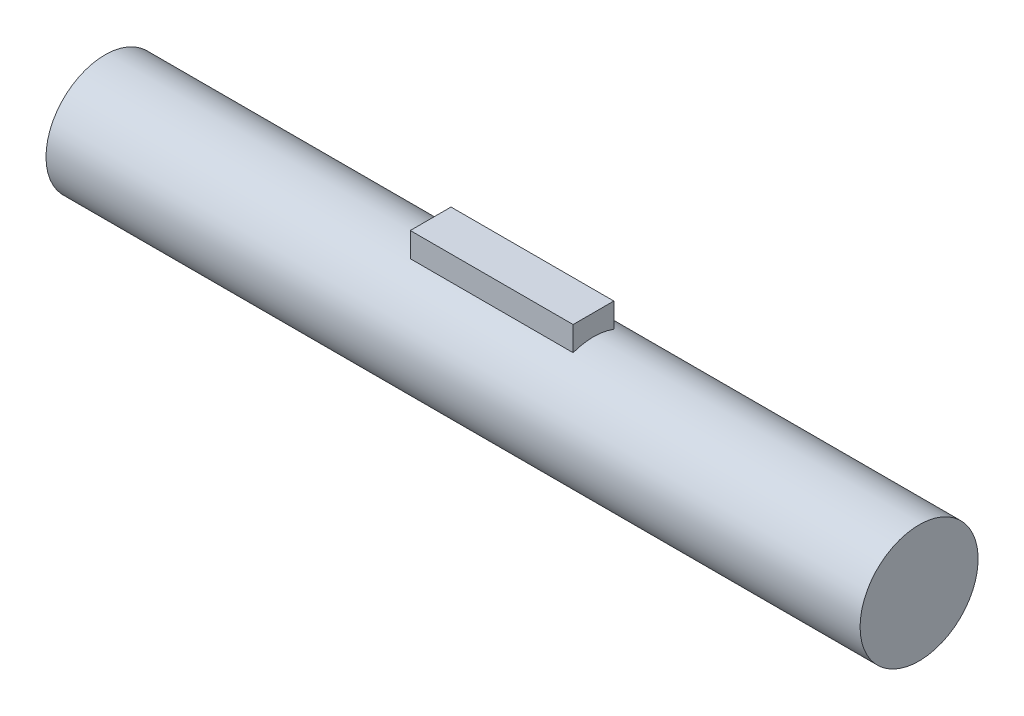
ISO-10303-21;
HEADER;
FILE_DESCRIPTION(('STEP AP214'),'2;1');
FILE_NAME('part.step','',(''),(''),'','','');
FILE_SCHEMA(('AUTOMOTIVE_DESIGN { 1 0 10303 214 1 1 1 1 }'));
ENDSEC;
DATA;
#1=APPLICATION_CONTEXT('core data for automotive mechanical design processes');
#2=APPLICATION_PROTOCOL_DEFINITION('international standard','automotive_design',2000,#1);
#3=PRODUCT_CONTEXT('',#1,'mechanical');
#4=PRODUCT('Part','Part','',(#3));
#5=PRODUCT_RELATED_PRODUCT_CATEGORY('part','',(#4));
#6=PRODUCT_DEFINITION_FORMATION('','',#4);
#7=PRODUCT_DEFINITION_CONTEXT('part definition',#1,'design');
#8=PRODUCT_DEFINITION('design','',#6,#7);
#9=PRODUCT_DEFINITION_SHAPE('','',#8);
#10=(LENGTH_UNIT() NAMED_UNIT(*) SI_UNIT(.MILLI.,.METRE.));
#11=(NAMED_UNIT(*) PLANE_ANGLE_UNIT() SI_UNIT($,.RADIAN.));
#12=(NAMED_UNIT(*) SI_UNIT($,.STERADIAN.) SOLID_ANGLE_UNIT());
#13=UNCERTAINTY_MEASURE_WITH_UNIT(LENGTH_MEASURE(1.E-05),#10,'distance_accuracy_value','');
#14=(GEOMETRIC_REPRESENTATION_CONTEXT(3) GLOBAL_UNCERTAINTY_ASSIGNED_CONTEXT((#13)) GLOBAL_UNIT_ASSIGNED_CONTEXT((#10,
#11,#12)) REPRESENTATION_CONTEXT('',''));
#15=CARTESIAN_POINT('',(0.,0.,0.));
#16=DIRECTION('',(0.,0.,1.));
#17=DIRECTION('',(1.,0.,0.));
#18=AXIS2_PLACEMENT_3D('',#15,#16,#17);
#19=CARTESIAN_POINT('',(2.,0.,0.));
#20=DIRECTION('',(1.,0.,0.));
#21=DIRECTION('',(0.,0.,-1.));
#22=AXIS2_PLACEMENT_3D('',#19,#20,#21);
#23=PLANE('',#22);
#24=DIRECTION('',(0.,-1.,0.));
#25=VECTOR('',#24,1.);
#26=CARTESIAN_POINT('',(2.,1.96106575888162,0.5));
#27=LINE('',#26,#25);
#28=CARTESIAN_POINT('',(2.,1.96106575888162,0.5));
#29=VERTEX_POINT('',#28);
#30=CARTESIAN_POINT('',(2.,1.36106575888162,0.5));
#31=VERTEX_POINT('',#30);
#32=EDGE_CURVE('E78',#29,#31,#27,.T.);
#33=ORIENTED_EDGE('',*,*,#32,.T.);
#34=CARTESIAN_POINT('',(2.,0.,0.));
#35=DIRECTION('',(-1.,0.,0.));
#36=DIRECTION('',(0.,0.,1.));
#37=AXIS2_PLACEMENT_3D('',#34,#35,#36);
#38=CIRCLE('',#37,1.45);
#39=CARTESIAN_POINT('',(2.,1.36106575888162,-0.5));
#40=VERTEX_POINT('',#39);
#41=EDGE_CURVE('E94',#31,#40,#38,.T.);
#42=ORIENTED_EDGE('',*,*,#41,.T.);
#43=DIRECTION('',(0.,1.,0.));
#44=VECTOR('',#43,1.);
#45=CARTESIAN_POINT('',(2.,1.96106575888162,-0.5));
#46=LINE('',#45,#44);
#47=CARTESIAN_POINT('',(2.,1.96106575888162,-0.5));
#48=VERTEX_POINT('',#47);
#49=EDGE_CURVE('E85',#40,#48,#46,.T.);
#50=ORIENTED_EDGE('',*,*,#49,.T.);
#51=DIRECTION('',(0.,0.,1.));
#52=VECTOR('',#51,1.);
#53=CARTESIAN_POINT('',(2.,1.96106575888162,-0.5));
#54=LINE('',#53,#52);
#55=EDGE_CURVE('E54',#48,#29,#54,.T.);
#56=ORIENTED_EDGE('',*,*,#55,.T.);
#57=EDGE_LOOP('',(#33,#42,#50,#56));
#58=FACE_BOUND('',#57,.T.);
#59=ADVANCED_FACE('F35',(#58),#23,.T.);
#60=CARTESIAN_POINT('',(-2.,0.,0.));
#61=DIRECTION('',(1.,0.,0.));
#62=DIRECTION('',(0.,0.,-1.));
#63=AXIS2_PLACEMENT_3D('',#60,#61,#62);
#64=PLANE('',#63);
#65=CARTESIAN_POINT('',(-2.,0.,0.));
#66=DIRECTION('',(-1.,0.,0.));
#67=DIRECTION('',(0.,0.,1.));
#68=AXIS2_PLACEMENT_3D('',#65,#66,#67);
#69=CIRCLE('',#68,1.45);
#70=CARTESIAN_POINT('',(-2.,1.36106575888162,0.5));
#71=VERTEX_POINT('',#70);
#72=CARTESIAN_POINT('',(-2.,1.36106575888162,-0.5));
#73=VERTEX_POINT('',#72);
#74=EDGE_CURVE('E95',#71,#73,#69,.T.);
#75=ORIENTED_EDGE('',*,*,#74,.F.);
#76=DIRECTION('',(0.,-1.,0.));
#77=VECTOR('',#76,1.);
#78=CARTESIAN_POINT('',(-2.,1.96106575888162,0.5));
#79=LINE('',#78,#77);
#80=CARTESIAN_POINT('',(-2.,1.96106575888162,0.5));
#81=VERTEX_POINT('',#80);
#82=EDGE_CURVE('E112',#81,#71,#79,.T.);
#83=ORIENTED_EDGE('',*,*,#82,.F.);
#84=DIRECTION('',(0.,0.,1.));
#85=VECTOR('',#84,1.);
#86=CARTESIAN_POINT('',(-2.,1.96106575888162,-0.5));
#87=LINE('',#86,#85);
#88=CARTESIAN_POINT('',(-2.,1.96106575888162,-0.5));
#89=VERTEX_POINT('',#88);
#90=EDGE_CURVE('E74',#89,#81,#87,.T.);
#91=ORIENTED_EDGE('',*,*,#90,.F.);
#92=DIRECTION('',(0.,1.,0.));
#93=VECTOR('',#92,1.);
#94=CARTESIAN_POINT('',(-2.,1.96106575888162,-0.5));
#95=LINE('',#94,#93);
#96=EDGE_CURVE('E69',#73,#89,#95,.T.);
#97=ORIENTED_EDGE('',*,*,#96,.F.);
#98=EDGE_LOOP('',(#75,#83,#91,#97));
#99=FACE_BOUND('',#98,.T.);
#100=ADVANCED_FACE('F133',(#99),#64,.F.);
#101=CARTESIAN_POINT('',(2.,1.96106575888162,0.5));
#102=DIRECTION('',(0.,0.,-1.));
#103=DIRECTION('',(0.,1.,0.));
#104=AXIS2_PLACEMENT_3D('',#101,#102,#103);
#105=PLANE('',#104);
#106=ORIENTED_EDGE('',*,*,#82,.T.);
#107=DIRECTION('',(-1.,0.,0.));
#108=VECTOR('',#107,1.);
#109=CARTESIAN_POINT('',(2.,1.36106575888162,0.5));
#110=LINE('',#109,#108);
#111=EDGE_CURVE('E11',#31,#71,#110,.T.);
#112=ORIENTED_EDGE('',*,*,#111,.F.);
#113=ORIENTED_EDGE('',*,*,#32,.F.);
#114=DIRECTION('',(-1.,0.,0.));
#115=VECTOR('',#114,1.);
#116=CARTESIAN_POINT('',(2.,1.96106575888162,0.5));
#117=LINE('',#116,#115);
#118=EDGE_CURVE('E116',#29,#81,#117,.T.);
#119=ORIENTED_EDGE('',*,*,#118,.T.);
#120=EDGE_LOOP('',(#106,#112,#113,#119));
#121=FACE_BOUND('',#120,.T.);
#122=ADVANCED_FACE('F37',(#121),#105,.F.);
#123=CARTESIAN_POINT('',(2.,0.,0.));
#124=DIRECTION('',(-1.,0.,0.));
#125=DIRECTION('',(0.,0.,1.));
#126=AXIS2_PLACEMENT_3D('',#123,#124,#125);
#127=CYLINDRICAL_SURFACE('',#126,1.45);
#128=ORIENTED_EDGE('',*,*,#111,.T.);
#129=ORIENTED_EDGE('',*,*,#74,.T.);
#130=DIRECTION('',(-1.,0.,0.));
#131=VECTOR('',#130,1.);
#132=CARTESIAN_POINT('',(2.,1.36106575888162,-0.5));
#133=LINE('',#132,#131);
#134=EDGE_CURVE('E45',#40,#73,#133,.T.);
#135=ORIENTED_EDGE('',*,*,#134,.F.);
#136=ORIENTED_EDGE('',*,*,#41,.F.);
#137=EDGE_LOOP('',(#128,#129,#135,#136));
#138=FACE_BOUND('',#137,.T.);
#139=CARTESIAN_POINT('',(-10.,0.,0.));
#140=DIRECTION('',(-1.,0.,0.));
#141=DIRECTION('',(0.,0.,1.));
#142=AXIS2_PLACEMENT_3D('',#139,#140,#141);
#143=CIRCLE('',#142,1.45);
#144=CARTESIAN_POINT('',(-10.,0.,1.45));
#145=VERTEX_POINT('',#144);
#146=EDGE_CURVE('E103',#145,#145,#143,.T.);
#147=ORIENTED_EDGE('',*,*,#146,.F.);
#148=EDGE_LOOP('',(#147));
#149=FACE_BOUND('',#148,.T.);
#150=CARTESIAN_POINT('',(10.,0.,0.));
#151=DIRECTION('',(-1.,0.,0.));
#152=DIRECTION('',(0.,0.,1.));
#153=AXIS2_PLACEMENT_3D('',#150,#151,#152);
#154=CIRCLE('',#153,1.45);
#155=CARTESIAN_POINT('',(10.,0.,1.45));
#156=VERTEX_POINT('',#155);
#157=EDGE_CURVE('E97',#156,#156,#154,.T.);
#158=ORIENTED_EDGE('',*,*,#157,.T.);
#159=EDGE_LOOP('',(#158));
#160=FACE_BOUND('',#159,.T.);
#161=ADVANCED_FACE('F92',(#138,#149,#160),#127,.T.);
#162=CARTESIAN_POINT('',(2.,1.96106575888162,-0.5));
#163=DIRECTION('',(0.,0.,1.));
#164=DIRECTION('',(1.,0.,0.));
#165=AXIS2_PLACEMENT_3D('',#162,#163,#164);
#166=PLANE('',#165);
#167=ORIENTED_EDGE('',*,*,#96,.T.);
#168=DIRECTION('',(-1.,0.,0.));
#169=VECTOR('',#168,1.);
#170=CARTESIAN_POINT('',(2.,1.96106575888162,-0.5));
#171=LINE('',#170,#169);
#172=EDGE_CURVE('E88',#48,#89,#171,.T.);
#173=ORIENTED_EDGE('',*,*,#172,.F.);
#174=ORIENTED_EDGE('',*,*,#49,.F.);
#175=ORIENTED_EDGE('',*,*,#134,.T.);
#176=EDGE_LOOP('',(#167,#173,#174,#175));
#177=FACE_BOUND('',#176,.T.);
#178=ADVANCED_FACE('F87',(#177),#166,.F.);
#179=CARTESIAN_POINT('',(2.,1.96106575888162,-0.5));
#180=DIRECTION('',(0.,-1.,0.));
#181=DIRECTION('',(0.,0.,-1.));
#182=AXIS2_PLACEMENT_3D('',#179,#180,#181);
#183=PLANE('',#182);
#184=ORIENTED_EDGE('',*,*,#90,.T.);
#185=ORIENTED_EDGE('',*,*,#118,.F.);
#186=ORIENTED_EDGE('',*,*,#55,.F.);
#187=ORIENTED_EDGE('',*,*,#172,.T.);
#188=EDGE_LOOP('',(#184,#185,#186,#187));
#189=FACE_BOUND('',#188,.T.);
#190=ADVANCED_FACE('F143',(#189),#183,.F.);
#191=CARTESIAN_POINT('',(-10.,0.,0.));
#192=DIRECTION('',(-1.,0.,0.));
#193=DIRECTION('',(0.,0.,1.));
#194=AXIS2_PLACEMENT_3D('',#191,#192,#193);
#195=PLANE('',#194);
#196=ORIENTED_EDGE('',*,*,#146,.T.);
#197=EDGE_LOOP('',(#196));
#198=FACE_BOUND('',#197,.T.);
#199=ADVANCED_FACE('F146',(#198),#195,.T.);
#200=CARTESIAN_POINT('',(10.,0.,0.));
#201=DIRECTION('',(1.,0.,0.));
#202=DIRECTION('',(0.,0.,1.));
#203=AXIS2_PLACEMENT_3D('',#200,#201,#202);
#204=PLANE('',#203);
#205=ORIENTED_EDGE('',*,*,#157,.F.);
#206=EDGE_LOOP('',(#205));
#207=FACE_BOUND('',#206,.T.);
#208=ADVANCED_FACE('F168',(#207),#204,.T.);
#209=CLOSED_SHELL('',(#59,#100,#122,#161,#178,#190,#199,#208));
#210=MANIFOLD_SOLID_BREP('B2',#209);
#211=ADVANCED_BREP_SHAPE_REPRESENTATION('',(#18,#210),#14);
#212=SHAPE_DEFINITION_REPRESENTATION(#9,#211);
ENDSEC;
END-ISO-10303-21;
